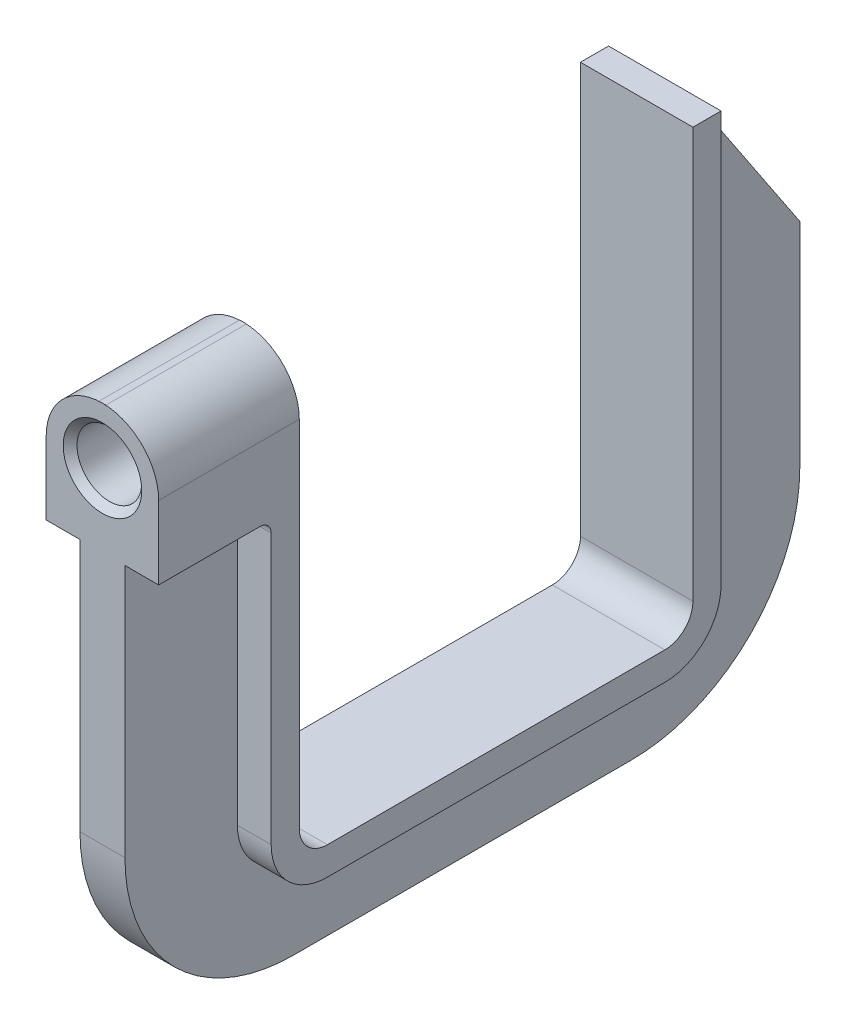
ISO-10303-21;
HEADER;
FILE_DESCRIPTION(('STEP AP214'),'2;1');
FILE_NAME('part.step','',(''),(''),'','','');
FILE_SCHEMA(('AUTOMOTIVE_DESIGN { 1 0 10303 214 1 1 1 1 }'));
ENDSEC;
DATA;
#1=APPLICATION_CONTEXT('core data for automotive mechanical design processes');
#2=APPLICATION_PROTOCOL_DEFINITION('international standard','automotive_design',2000,#1);
#3=PRODUCT_CONTEXT('',#1,'mechanical');
#4=PRODUCT('Part','Part','',(#3));
#5=PRODUCT_RELATED_PRODUCT_CATEGORY('part','',(#4));
#6=PRODUCT_DEFINITION_FORMATION('','',#4);
#7=PRODUCT_DEFINITION_CONTEXT('part definition',#1,'design');
#8=PRODUCT_DEFINITION('design','',#6,#7);
#9=PRODUCT_DEFINITION_SHAPE('','',#8);
#10=(LENGTH_UNIT() NAMED_UNIT(*) SI_UNIT(.MILLI.,.METRE.));
#11=(NAMED_UNIT(*) PLANE_ANGLE_UNIT() SI_UNIT($,.RADIAN.));
#12=(NAMED_UNIT(*) SI_UNIT($,.STERADIAN.) SOLID_ANGLE_UNIT());
#13=UNCERTAINTY_MEASURE_WITH_UNIT(LENGTH_MEASURE(1.E-05),#10,'distance_accuracy_value','');
#14=(GEOMETRIC_REPRESENTATION_CONTEXT(3) GLOBAL_UNCERTAINTY_ASSIGNED_CONTEXT((#13)) GLOBAL_UNIT_ASSIGNED_CONTEXT((#10,
#11,#12)) REPRESENTATION_CONTEXT('',''));
#15=CARTESIAN_POINT('',(0.,0.,0.));
#16=DIRECTION('',(0.,0.,1.));
#17=DIRECTION('',(1.,0.,0.));
#18=AXIS2_PLACEMENT_3D('',#15,#16,#17);
#19=CARTESIAN_POINT('',(4.,0.,95.));
#20=DIRECTION('',(0.,0.,1.));
#21=DIRECTION('',(1.,0.,0.));
#22=AXIS2_PLACEMENT_3D('',#19,#20,#21);
#23=PLANE('',#22);
#24=CARTESIAN_POINT('',(0.,-10.0000173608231,95.));
#25=DIRECTION('',(0.,0.,1.));
#26=DIRECTION('',(1.,0.,0.));
#27=AXIS2_PLACEMENT_3D('',#24,#25,#26);
#28=CIRCLE('',#27,6.985);
#29=CARTESIAN_POINT('',(6.985,-10.0000173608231,95.));
#30=VERTEX_POINT('',#29);
#31=EDGE_CURVE('E570',#30,#30,#28,.T.);
#32=ORIENTED_EDGE('',*,*,#31,.F.);
#33=EDGE_LOOP('',(#32));
#34=FACE_BOUND('',#33,.T.);
#35=CARTESIAN_POINT('',(0.,-10.0000173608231,95.));
#36=DIRECTION('',(0.,0.,1.));
#37=DIRECTION('',(1.,0.,0.));
#38=AXIS2_PLACEMENT_3D('',#35,#36,#37);
#39=CIRCLE('',#38,10.0000173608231);
#40=CARTESIAN_POINT('',(10.,-9.98138360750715,95.));
#41=VERTEX_POINT('',#40);
#42=CARTESIAN_POINT('',(-10.,-9.98138360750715,95.));
#43=VERTEX_POINT('',#42);
#44=EDGE_CURVE('E296',#41,#43,#39,.T.);
#45=ORIENTED_EDGE('',*,*,#44,.T.);
#46=DIRECTION('',(0.,-1.,0.));
#47=VECTOR('',#46,1.);
#48=CARTESIAN_POINT('',(-10.,-9.98138360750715,95.));
#49=LINE('',#48,#47);
#50=CARTESIAN_POINT('',(-10.,-23.,95.));
#51=VERTEX_POINT('',#50);
#52=EDGE_CURVE('E292',#43,#51,#49,.T.);
#53=ORIENTED_EDGE('',*,*,#52,.T.);
#54=DIRECTION('',(1.,0.,0.));
#55=VECTOR('',#54,1.);
#56=CARTESIAN_POINT('',(-10.,-23.,95.));
#57=LINE('',#56,#55);
#58=CARTESIAN_POINT('',(-4.,-23.,95.));
#59=VERTEX_POINT('',#58);
#60=EDGE_CURVE('E283',#51,#59,#57,.T.);
#61=ORIENTED_EDGE('',*,*,#60,.T.);
#62=DIRECTION('',(0.,1.,0.));
#63=VECTOR('',#62,1.);
#64=CARTESIAN_POINT('',(-4.,0.,95.));
#65=LINE('',#64,#63);
#66=CARTESIAN_POINT('',(-4.,-67.9999999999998,95.));
#67=VERTEX_POINT('',#66);
#68=EDGE_CURVE('E355',#67,#59,#65,.T.);
#69=ORIENTED_EDGE('',*,*,#68,.F.);
#70=DIRECTION('',(-1.,0.,0.));
#71=VECTOR('',#70,1.);
#72=CARTESIAN_POINT('',(4.,-67.9999999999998,95.));
#73=LINE('',#72,#71);
#74=CARTESIAN_POINT('',(4.,-67.9999999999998,95.));
#75=VERTEX_POINT('',#74);
#76=EDGE_CURVE('E281',#75,#67,#73,.T.);
#77=ORIENTED_EDGE('',*,*,#76,.F.);
#78=DIRECTION('',(0.,1.,0.));
#79=VECTOR('',#78,1.);
#80=CARTESIAN_POINT('',(4.,0.,95.));
#81=LINE('',#80,#79);
#82=CARTESIAN_POINT('',(4.,-23.,95.));
#83=VERTEX_POINT('',#82);
#84=EDGE_CURVE('E264',#75,#83,#81,.T.);
#85=ORIENTED_EDGE('',*,*,#84,.T.);
#86=CARTESIAN_POINT('',(10.,-23.,95.));
#87=VERTEX_POINT('',#86);
#88=EDGE_CURVE('E278',#83,#87,#57,.T.);
#89=ORIENTED_EDGE('',*,*,#88,.T.);
#90=DIRECTION('',(0.,1.,0.));
#91=VECTOR('',#90,1.);
#92=CARTESIAN_POINT('',(10.,-23.,95.));
#93=LINE('',#92,#91);
#94=EDGE_CURVE('E286',#87,#41,#93,.T.);
#95=ORIENTED_EDGE('',*,*,#94,.T.);
#96=EDGE_LOOP('',(#45,#53,#61,#69,#77,#85,#89,#95));
#97=FACE_BOUND('',#96,.T.);
#98=ADVANCED_FACE('F75',(#34,#97),#23,.T.);
#99=CARTESIAN_POINT('',(10.,0.,70.));
#100=DIRECTION('',(0.,0.,1.));
#101=DIRECTION('',(1.,0.,0.));
#102=AXIS2_PLACEMENT_3D('',#99,#100,#101);
#103=PLANE('',#102);
#104=CARTESIAN_POINT('',(0.,-10.0000173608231,70.));
#105=DIRECTION('',(0.,0.,1.));
#106=DIRECTION('',(1.,0.,0.));
#107=AXIS2_PLACEMENT_3D('',#104,#105,#106);
#108=CIRCLE('',#107,5.75436999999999);
#109=CARTESIAN_POINT('',(5.75436999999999,-10.0000173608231,70.));
#110=VERTEX_POINT('',#109);
#111=EDGE_CURVE('E298',#110,#110,#108,.T.);
#112=ORIENTED_EDGE('',*,*,#111,.T.);
#113=EDGE_LOOP('',(#112));
#114=FACE_BOUND('',#113,.T.);
#115=CARTESIAN_POINT('',(0.,-10.0000173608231,70.));
#116=DIRECTION('',(0.,0.,1.));
#117=DIRECTION('',(1.,0.,0.));
#118=AXIS2_PLACEMENT_3D('',#115,#116,#117);
#119=CIRCLE('',#118,10.0000173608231);
#120=CARTESIAN_POINT('',(-10.,-9.98138360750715,70.));
#121=VERTEX_POINT('',#120);
#122=CARTESIAN_POINT('',(10.,-9.98138360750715,70.));
#123=VERTEX_POINT('',#122);
#124=EDGE_CURVE('E288',#121,#123,#119,.F.);
#125=ORIENTED_EDGE('',*,*,#124,.T.);
#126=DIRECTION('',(0.,1.,0.));
#127=VECTOR('',#126,1.);
#128=CARTESIAN_POINT('',(10.,0.,70.));
#129=LINE('',#128,#127);
#130=CARTESIAN_POINT('',(10.,-73.,70.));
#131=VERTEX_POINT('',#130);
#132=EDGE_CURVE('E331',#131,#123,#129,.T.);
#133=ORIENTED_EDGE('',*,*,#132,.F.);
#134=DIRECTION('',(-1.,0.,0.));
#135=VECTOR('',#134,1.);
#136=CARTESIAN_POINT('',(10.,-73.,70.));
#137=LINE('',#136,#135);
#138=CARTESIAN_POINT('',(-10.,-73.,70.));
#139=VERTEX_POINT('',#138);
#140=EDGE_CURVE('E302',#131,#139,#137,.T.);
#141=ORIENTED_EDGE('',*,*,#140,.T.);
#142=DIRECTION('',(0.,1.,0.));
#143=VECTOR('',#142,1.);
#144=CARTESIAN_POINT('',(-10.,0.,70.));
#145=LINE('',#144,#143);
#146=EDGE_CURVE('E445',#139,#121,#145,.T.);
#147=ORIENTED_EDGE('',*,*,#146,.T.);
#148=EDGE_LOOP('',(#125,#133,#141,#147));
#149=FACE_BOUND('',#148,.T.);
#150=ADVANCED_FACE('F499',(#114,#149),#103,.F.);
#151=CARTESIAN_POINT('',(-10.,0.,0.));
#152=DIRECTION('',(1.,0.,0.));
#153=DIRECTION('',(0.,0.,-1.));
#154=AXIS2_PLACEMENT_3D('',#151,#152,#153);
#155=PLANE('',#154);
#156=DIRECTION('',(0.,0.,1.));
#157=VECTOR('',#156,1.);
#158=CARTESIAN_POINT('',(-10.,-9.98138360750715,55.8710220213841));
#159=LINE('',#158,#157);
#160=EDGE_CURVE('E303',#121,#43,#159,.T.);
#161=ORIENTED_EDGE('',*,*,#160,.F.);
#162=ORIENTED_EDGE('',*,*,#146,.F.);
#163=CARTESIAN_POINT('',(-10.,-73.,65.));
#164=DIRECTION('',(1.,0.,0.));
#165=DIRECTION('',(0.,0.,-1.));
#166=AXIS2_PLACEMENT_3D('',#163,#164,#165);
#167=CIRCLE('',#166,5.);
#168=CARTESIAN_POINT('',(-10.,-78.,65.));
#169=VERTEX_POINT('',#168);
#170=EDGE_CURVE('E440',#169,#139,#167,.F.);
#171=ORIENTED_EDGE('',*,*,#170,.F.);
#172=DIRECTION('',(0.,0.,1.));
#173=VECTOR('',#172,1.);
#174=CARTESIAN_POINT('',(-10.,-78.,0.));
#175=LINE('',#174,#173);
#176=CARTESIAN_POINT('',(-10.,-78.,4.99999999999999));
#177=VERTEX_POINT('',#176);
#178=EDGE_CURVE('E436',#177,#169,#175,.T.);
#179=ORIENTED_EDGE('',*,*,#178,.F.);
#180=CARTESIAN_POINT('',(-10.,-73.,4.99999999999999));
#181=DIRECTION('',(1.,0.,0.));
#182=DIRECTION('',(0.,0.,-1.));
#183=AXIS2_PLACEMENT_3D('',#180,#181,#182);
#184=CIRCLE('',#183,5.);
#185=CARTESIAN_POINT('',(-10.,-73.,0.));
#186=VERTEX_POINT('',#185);
#187=EDGE_CURVE('E431',#186,#177,#184,.F.);
#188=ORIENTED_EDGE('',*,*,#187,.F.);
#189=DIRECTION('',(0.,-1.,0.));
#190=VECTOR('',#189,1.);
#191=CARTESIAN_POINT('',(-10.,0.,0.));
#192=LINE('',#191,#190);
#193=CARTESIAN_POINT('',(-10.,0.,0.));
#194=VERTEX_POINT('',#193);
#195=EDGE_CURVE('E432',#194,#186,#192,.T.);
#196=ORIENTED_EDGE('',*,*,#195,.F.);
#197=DIRECTION('',(0.,0.,-1.));
#198=VECTOR('',#197,1.);
#199=CARTESIAN_POINT('',(-10.,0.,0.));
#200=LINE('',#199,#198);
#201=CARTESIAN_POINT('',(-10.,0.,-5.));
#202=VERTEX_POINT('',#201);
#203=EDGE_CURVE('E451',#194,#202,#200,.T.);
#204=ORIENTED_EDGE('',*,*,#203,.T.);
#205=DIRECTION('',(0.,-1.,0.));
#206=VECTOR('',#205,1.);
#207=CARTESIAN_POINT('',(-10.,0.,-5.));
#208=LINE('',#207,#206);
#209=CARTESIAN_POINT('',(-10.,-73.,-5.00000000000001));
#210=VERTEX_POINT('',#209);
#211=EDGE_CURVE('E458',#202,#210,#208,.T.);
#212=ORIENTED_EDGE('',*,*,#211,.T.);
#213=CARTESIAN_POINT('',(-10.,-73.,4.99999999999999));
#214=DIRECTION('',(1.,0.,0.));
#215=DIRECTION('',(0.,0.,-1.));
#216=AXIS2_PLACEMENT_3D('',#213,#214,#215);
#217=CIRCLE('',#216,10.);
#218=CARTESIAN_POINT('',(-10.,-83.,4.99999999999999));
#219=VERTEX_POINT('',#218);
#220=EDGE_CURVE('E461',#210,#219,#217,.F.);
#221=ORIENTED_EDGE('',*,*,#220,.T.);
#222=DIRECTION('',(0.,0.,1.));
#223=VECTOR('',#222,1.);
#224=CARTESIAN_POINT('',(-10.,-83.,0.));
#225=LINE('',#224,#223);
#226=CARTESIAN_POINT('',(-10.,-83.,65.));
#227=VERTEX_POINT('',#226);
#228=EDGE_CURVE('E464',#219,#227,#225,.T.);
#229=ORIENTED_EDGE('',*,*,#228,.T.);
#230=CARTESIAN_POINT('',(-10.,-73.,65.));
#231=DIRECTION('',(1.,0.,0.));
#232=DIRECTION('',(0.,0.,-1.));
#233=AXIS2_PLACEMENT_3D('',#230,#231,#232);
#234=CIRCLE('',#233,10.);
#235=CARTESIAN_POINT('',(-10.,-73.,75.));
#236=VERTEX_POINT('',#235);
#237=EDGE_CURVE('E448',#227,#236,#234,.F.);
#238=ORIENTED_EDGE('',*,*,#237,.T.);
#239=DIRECTION('',(0.,1.,0.));
#240=VECTOR('',#239,1.);
#241=CARTESIAN_POINT('',(-10.,0.,75.));
#242=LINE('',#241,#240);
#243=CARTESIAN_POINT('',(-10.,-25.,75.));
#244=VERTEX_POINT('',#243);
#245=EDGE_CURVE('E324',#236,#244,#242,.T.);
#246=ORIENTED_EDGE('',*,*,#245,.T.);
#247=CARTESIAN_POINT('',(-10.,-25.,77.));
#248=DIRECTION('',(1.,0.,0.));
#249=DIRECTION('',(0.,0.,-1.));
#250=AXIS2_PLACEMENT_3D('',#247,#248,#249);
#251=CIRCLE('',#250,2.);
#252=CARTESIAN_POINT('',(-10.,-23.,77.));
#253=VERTEX_POINT('',#252);
#254=EDGE_CURVE('E83',#244,#253,#251,.T.);
#255=ORIENTED_EDGE('',*,*,#254,.T.);
#256=DIRECTION('',(0.,0.,1.));
#257=VECTOR('',#256,1.);
#258=CARTESIAN_POINT('',(-10.,-23.,39.5064482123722));
#259=LINE('',#258,#257);
#260=EDGE_CURVE('E321',#253,#51,#259,.T.);
#261=ORIENTED_EDGE('',*,*,#260,.T.);
#262=ORIENTED_EDGE('',*,*,#52,.F.);
#263=EDGE_LOOP('',(#161,#162,#171,#179,#188,#196,#204,#212,#221,#229,#238,#246,#255,#261,#262));
#264=FACE_BOUND('',#263,.T.);
#265=ADVANCED_FACE('F320',(#264),#155,.F.);
#266=CARTESIAN_POINT('',(10.,0.,0.));
#267=DIRECTION('',(1.,0.,0.));
#268=DIRECTION('',(0.,0.,-1.));
#269=AXIS2_PLACEMENT_3D('',#266,#267,#268);
#270=PLANE('',#269);
#271=ORIENTED_EDGE('',*,*,#132,.T.);
#272=DIRECTION('',(0.,0.,1.));
#273=VECTOR('',#272,1.);
#274=CARTESIAN_POINT('',(10.,-9.98138360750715,39.5064482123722));
#275=LINE('',#274,#273);
#276=EDGE_CURVE('E471',#123,#41,#275,.T.);
#277=ORIENTED_EDGE('',*,*,#276,.T.);
#278=ORIENTED_EDGE('',*,*,#94,.F.);
#279=DIRECTION('',(0.,0.,1.));
#280=VECTOR('',#279,1.);
#281=CARTESIAN_POINT('',(10.,-23.,39.5064482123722));
#282=LINE('',#281,#280);
#283=CARTESIAN_POINT('',(10.,-23.,77.));
#284=VERTEX_POINT('',#283);
#285=EDGE_CURVE('E271',#284,#87,#282,.T.);
#286=ORIENTED_EDGE('',*,*,#285,.F.);
#287=CARTESIAN_POINT('',(10.,-25.,77.));
#288=DIRECTION('',(1.,0.,0.));
#289=DIRECTION('',(0.,0.,-1.));
#290=AXIS2_PLACEMENT_3D('',#287,#288,#289);
#291=CIRCLE('',#290,2.);
#292=CARTESIAN_POINT('',(10.,-25.,75.));
#293=VERTEX_POINT('',#292);
#294=EDGE_CURVE('E13',#284,#293,#291,.F.);
#295=ORIENTED_EDGE('',*,*,#294,.T.);
#296=DIRECTION('',(0.,1.,0.));
#297=VECTOR('',#296,1.);
#298=CARTESIAN_POINT('',(10.,0.,75.));
#299=LINE('',#298,#297);
#300=CARTESIAN_POINT('',(10.,-73.,75.));
#301=VERTEX_POINT('',#300);
#302=EDGE_CURVE('E272',#301,#293,#299,.T.);
#303=ORIENTED_EDGE('',*,*,#302,.F.);
#304=CARTESIAN_POINT('',(10.,-73.,65.));
#305=DIRECTION('',(1.,0.,0.));
#306=DIRECTION('',(0.,0.,-1.));
#307=AXIS2_PLACEMENT_3D('',#304,#305,#306);
#308=CIRCLE('',#307,10.);
#309=CARTESIAN_POINT('',(10.,-83.,65.));
#310=VERTEX_POINT('',#309);
#311=EDGE_CURVE('E348',#310,#301,#308,.F.);
#312=ORIENTED_EDGE('',*,*,#311,.F.);
#313=DIRECTION('',(0.,0.,1.));
#314=VECTOR('',#313,1.);
#315=CARTESIAN_POINT('',(10.,-83.,0.));
#316=LINE('',#315,#314);
#317=CARTESIAN_POINT('',(10.,-83.,4.99999999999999));
#318=VERTEX_POINT('',#317);
#319=EDGE_CURVE('E416',#318,#310,#316,.T.);
#320=ORIENTED_EDGE('',*,*,#319,.F.);
#321=CARTESIAN_POINT('',(10.,-73.,4.99999999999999));
#322=DIRECTION('',(1.,0.,0.));
#323=DIRECTION('',(0.,0.,-1.));
#324=AXIS2_PLACEMENT_3D('',#321,#322,#323);
#325=CIRCLE('',#324,10.);
#326=CARTESIAN_POINT('',(10.,-73.,-5.00000000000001));
#327=VERTEX_POINT('',#326);
#328=EDGE_CURVE('E419',#327,#318,#325,.F.);
#329=ORIENTED_EDGE('',*,*,#328,.F.);
#330=DIRECTION('',(0.,-1.,0.));
#331=VECTOR('',#330,1.);
#332=CARTESIAN_POINT('',(10.,0.,-5.));
#333=LINE('',#332,#331);
#334=CARTESIAN_POINT('',(10.,0.,-5.));
#335=VERTEX_POINT('',#334);
#336=EDGE_CURVE('E422',#335,#327,#333,.T.);
#337=ORIENTED_EDGE('',*,*,#336,.F.);
#338=DIRECTION('',(0.,0.,-1.));
#339=VECTOR('',#338,1.);
#340=CARTESIAN_POINT('',(10.,0.,0.));
#341=LINE('',#340,#339);
#342=CARTESIAN_POINT('',(10.,0.,0.));
#343=VERTEX_POINT('',#342);
#344=EDGE_CURVE('E427',#343,#335,#341,.T.);
#345=ORIENTED_EDGE('',*,*,#344,.F.);
#346=DIRECTION('',(0.,-1.,0.));
#347=VECTOR('',#346,1.);
#348=CARTESIAN_POINT('',(10.,0.,0.));
#349=LINE('',#348,#347);
#350=CARTESIAN_POINT('',(10.,-73.,0.));
#351=VERTEX_POINT('',#350);
#352=EDGE_CURVE('E477',#343,#351,#349,.T.);
#353=ORIENTED_EDGE('',*,*,#352,.T.);
#354=CARTESIAN_POINT('',(10.,-73.,4.99999999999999));
#355=DIRECTION('',(1.,0.,0.));
#356=DIRECTION('',(0.,0.,-1.));
#357=AXIS2_PLACEMENT_3D('',#354,#355,#356);
#358=CIRCLE('',#357,5.);
#359=CARTESIAN_POINT('',(10.,-78.,4.99999999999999));
#360=VERTEX_POINT('',#359);
#361=EDGE_CURVE('E475',#351,#360,#358,.F.);
#362=ORIENTED_EDGE('',*,*,#361,.T.);
#363=DIRECTION('',(0.,0.,1.));
#364=VECTOR('',#363,1.);
#365=CARTESIAN_POINT('',(10.,-78.,0.));
#366=LINE('',#365,#364);
#367=CARTESIAN_POINT('',(10.,-78.,65.));
#368=VERTEX_POINT('',#367);
#369=EDGE_CURVE('E473',#360,#368,#366,.T.);
#370=ORIENTED_EDGE('',*,*,#369,.T.);
#371=CARTESIAN_POINT('',(10.,-73.,65.));
#372=DIRECTION('',(1.,0.,0.));
#373=DIRECTION('',(0.,0.,-1.));
#374=AXIS2_PLACEMENT_3D('',#371,#372,#373);
#375=CIRCLE('',#374,5.);
#376=EDGE_CURVE('E412',#368,#131,#375,.F.);
#377=ORIENTED_EDGE('',*,*,#376,.T.);
#378=EDGE_LOOP('',(#271,#277,#278,#286,#295,#303,#312,#320,#329,#337,#345,#353,#362,#370,#377));
#379=FACE_BOUND('',#378,.T.);
#380=ADVANCED_FACE('F493',(#379),#270,.T.);
#381=CARTESIAN_POINT('',(4.,-68.,65.));
#382=DIRECTION('',(-1.,0.,0.));
#383=DIRECTION('',(0.,0.,1.));
#384=AXIS2_PLACEMENT_3D('',#381,#382,#383);
#385=CYLINDRICAL_SURFACE('',#384,30.);
#386=CARTESIAN_POINT('',(-4.,-68.,65.));
#387=DIRECTION('',(1.,0.,0.));
#388=DIRECTION('',(0.,0.,-1.));
#389=AXIS2_PLACEMENT_3D('',#386,#387,#388);
#390=CIRCLE('',#389,30.);
#391=CARTESIAN_POINT('',(-4.,-98.,64.9999999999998));
#392=VERTEX_POINT('',#391);
#393=EDGE_CURVE('E359',#392,#67,#390,.F.);
#394=ORIENTED_EDGE('',*,*,#393,.F.);
#395=DIRECTION('',(-1.,0.,0.));
#396=VECTOR('',#395,1.);
#397=CARTESIAN_POINT('',(4.,-98.,64.9999999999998));
#398=LINE('',#397,#396);
#399=CARTESIAN_POINT('',(4.,-98.,64.9999999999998));
#400=VERTEX_POINT('',#399);
#401=EDGE_CURVE('E406',#400,#392,#398,.T.);
#402=ORIENTED_EDGE('',*,*,#401,.F.);
#403=CARTESIAN_POINT('',(4.,-68.,65.));
#404=DIRECTION('',(1.,0.,0.));
#405=DIRECTION('',(0.,0.,-1.));
#406=AXIS2_PLACEMENT_3D('',#403,#404,#405);
#407=CIRCLE('',#406,30.);
#408=EDGE_CURVE('E410',#400,#75,#407,.F.);
#409=ORIENTED_EDGE('',*,*,#408,.T.);
#410=ORIENTED_EDGE('',*,*,#76,.T.);
#411=EDGE_LOOP('',(#394,#402,#409,#410));
#412=FACE_BOUND('',#411,.T.);
#413=ADVANCED_FACE('F561',(#412),#385,.T.);
#414=CARTESIAN_POINT('',(4.,-98.,0.));
#415=DIRECTION('',(0.,-1.,0.));
#416=DIRECTION('',(0.,0.,-1.));
#417=AXIS2_PLACEMENT_3D('',#414,#415,#416);
#418=PLANE('',#417);
#419=DIRECTION('',(0.,0.,1.));
#420=VECTOR('',#419,1.);
#421=CARTESIAN_POINT('',(-4.,-98.,0.));
#422=LINE('',#421,#420);
#423=CARTESIAN_POINT('',(-4.,-98.,5.00000000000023));
#424=VERTEX_POINT('',#423);
#425=EDGE_CURVE('E379',#424,#392,#422,.T.);
#426=ORIENTED_EDGE('',*,*,#425,.F.);
#427=DIRECTION('',(-1.,0.,0.));
#428=VECTOR('',#427,1.);
#429=CARTESIAN_POINT('',(4.,-98.,5.00000000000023));
#430=LINE('',#429,#428);
#431=CARTESIAN_POINT('',(4.,-98.,5.00000000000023));
#432=VERTEX_POINT('',#431);
#433=EDGE_CURVE('E402',#432,#424,#430,.T.);
#434=ORIENTED_EDGE('',*,*,#433,.F.);
#435=DIRECTION('',(0.,0.,1.));
#436=VECTOR('',#435,1.);
#437=CARTESIAN_POINT('',(4.,-98.,0.));
#438=LINE('',#437,#436);
#439=EDGE_CURVE('E407',#432,#400,#438,.T.);
#440=ORIENTED_EDGE('',*,*,#439,.T.);
#441=ORIENTED_EDGE('',*,*,#401,.T.);
#442=EDGE_LOOP('',(#426,#434,#440,#441));
#443=FACE_BOUND('',#442,.T.);
#444=ADVANCED_FACE('F557',(#443),#418,.T.);
#445=CARTESIAN_POINT('',(4.,-68.,5.));
#446=DIRECTION('',(-1.,0.,0.));
#447=DIRECTION('',(0.,0.,1.));
#448=AXIS2_PLACEMENT_3D('',#445,#446,#447);
#449=CYLINDRICAL_SURFACE('',#448,30.);
#450=CARTESIAN_POINT('',(-4.,-68.,5.));
#451=DIRECTION('',(1.,0.,0.));
#452=DIRECTION('',(0.,0.,-1.));
#453=AXIS2_PLACEMENT_3D('',#450,#451,#452);
#454=CIRCLE('',#453,30.);
#455=CARTESIAN_POINT('',(-4.,-67.9999999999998,-25.));
#456=VERTEX_POINT('',#455);
#457=EDGE_CURVE('E376',#456,#424,#454,.F.);
#458=ORIENTED_EDGE('',*,*,#457,.F.);
#459=DIRECTION('',(-1.,0.,0.));
#460=VECTOR('',#459,1.);
#461=CARTESIAN_POINT('',(4.,-67.9999999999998,-25.));
#462=LINE('',#461,#460);
#463=CARTESIAN_POINT('',(4.,-67.9999999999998,-25.));
#464=VERTEX_POINT('',#463);
#465=EDGE_CURVE('E398',#464,#456,#462,.T.);
#466=ORIENTED_EDGE('',*,*,#465,.F.);
#467=CARTESIAN_POINT('',(4.,-68.,5.));
#468=DIRECTION('',(1.,0.,0.));
#469=DIRECTION('',(0.,0.,-1.));
#470=AXIS2_PLACEMENT_3D('',#467,#468,#469);
#471=CIRCLE('',#470,30.);
#472=EDGE_CURVE('E403',#464,#432,#471,.F.);
#473=ORIENTED_EDGE('',*,*,#472,.T.);
#474=ORIENTED_EDGE('',*,*,#433,.T.);
#475=EDGE_LOOP('',(#458,#466,#473,#474));
#476=FACE_BOUND('',#475,.T.);
#477=ADVANCED_FACE('F552',(#476),#449,.T.);
#478=CARTESIAN_POINT('',(4.,0.,-25.));
#479=DIRECTION('',(0.,0.,-1.));
#480=DIRECTION('',(0.,1.,0.));
#481=AXIS2_PLACEMENT_3D('',#478,#479,#480);
#482=PLANE('',#481);
#483=DIRECTION('',(0.,-1.,0.));
#484=VECTOR('',#483,1.);
#485=CARTESIAN_POINT('',(-4.,0.,-25.));
#486=LINE('',#485,#484);
#487=CARTESIAN_POINT('',(-4.,-30.,-25.));
#488=VERTEX_POINT('',#487);
#489=EDGE_CURVE('E373',#488,#456,#486,.T.);
#490=ORIENTED_EDGE('',*,*,#489,.F.);
#491=DIRECTION('',(-1.,0.,0.));
#492=VECTOR('',#491,1.);
#493=CARTESIAN_POINT('',(4.,-30.,-25.));
#494=LINE('',#493,#492);
#495=CARTESIAN_POINT('',(4.,-30.,-25.));
#496=VERTEX_POINT('',#495);
#497=EDGE_CURVE('E394',#496,#488,#494,.T.);
#498=ORIENTED_EDGE('',*,*,#497,.F.);
#499=DIRECTION('',(0.,-1.,0.));
#500=VECTOR('',#499,1.);
#501=CARTESIAN_POINT('',(4.,0.,-25.));
#502=LINE('',#501,#500);
#503=EDGE_CURVE('E399',#496,#464,#502,.T.);
#504=ORIENTED_EDGE('',*,*,#503,.T.);
#505=ORIENTED_EDGE('',*,*,#465,.T.);
#506=EDGE_LOOP('',(#490,#498,#504,#505));
#507=FACE_BOUND('',#506,.T.);
#508=ADVANCED_FACE('F548',(#507),#482,.T.);
#509=CARTESIAN_POINT('',(4.,2.30769230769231,-3.46153846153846));
#510=DIRECTION('',(0.,0.554700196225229,-0.832050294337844));
#511=DIRECTION('',(0.,0.832050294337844,0.554700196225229));
#512=AXIS2_PLACEMENT_3D('',#509,#510,#511);
#513=PLANE('',#512);
#514=DIRECTION('',(0.,-0.832050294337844,-0.554700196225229));
#515=VECTOR('',#514,1.);
#516=CARTESIAN_POINT('',(-4.,2.30769230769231,-3.46153846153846));
#517=LINE('',#516,#515);
#518=CARTESIAN_POINT('',(-4.,0.,-5.));
#519=VERTEX_POINT('',#518);
#520=EDGE_CURVE('E370',#519,#488,#517,.T.);
#521=ORIENTED_EDGE('',*,*,#520,.F.);
#522=DIRECTION('',(-1.,0.,0.));
#523=VECTOR('',#522,1.);
#524=CARTESIAN_POINT('',(4.,0.,-5.));
#525=LINE('',#524,#523);
#526=CARTESIAN_POINT('',(4.,0.,-5.));
#527=VERTEX_POINT('',#526);
#528=EDGE_CURVE('E426',#527,#519,#525,.T.);
#529=ORIENTED_EDGE('',*,*,#528,.F.);
#530=DIRECTION('',(0.,-0.832050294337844,-0.554700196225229));
#531=VECTOR('',#530,1.);
#532=CARTESIAN_POINT('',(4.,2.30769230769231,-3.46153846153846));
#533=LINE('',#532,#531);
#534=EDGE_CURVE('E395',#527,#496,#533,.T.);
#535=ORIENTED_EDGE('',*,*,#534,.T.);
#536=ORIENTED_EDGE('',*,*,#497,.T.);
#537=EDGE_LOOP('',(#521,#529,#535,#536));
#538=FACE_BOUND('',#537,.T.);
#539=ADVANCED_FACE('F542',(#538),#513,.T.);
#540=CARTESIAN_POINT('',(4.,0.,0.));
#541=DIRECTION('',(1.,0.,0.));
#542=DIRECTION('',(0.,0.,-1.));
#543=AXIS2_PLACEMENT_3D('',#540,#541,#542);
#544=PLANE('',#543);
#545=DIRECTION('',(0.,1.,0.));
#546=VECTOR('',#545,1.);
#547=CARTESIAN_POINT('',(4.,0.,75.));
#548=LINE('',#547,#546);
#549=CARTESIAN_POINT('',(4.,-73.,75.));
#550=VERTEX_POINT('',#549);
#551=CARTESIAN_POINT('',(4.,-25.,75.));
#552=VERTEX_POINT('',#551);
#553=EDGE_CURVE('E384',#550,#552,#548,.T.);
#554=ORIENTED_EDGE('',*,*,#553,.T.);
#555=CARTESIAN_POINT('',(4.,-25.,77.));
#556=DIRECTION('',(1.,0.,0.));
#557=DIRECTION('',(0.,0.,-1.));
#558=AXIS2_PLACEMENT_3D('',#555,#556,#557);
#559=CIRCLE('',#558,2.);
#560=CARTESIAN_POINT('',(4.,-23.,77.));
#561=VERTEX_POINT('',#560);
#562=EDGE_CURVE('E266',#552,#561,#559,.T.);
#563=ORIENTED_EDGE('',*,*,#562,.T.);
#564=DIRECTION('',(0.,0.,-1.));
#565=VECTOR('',#564,1.);
#566=CARTESIAN_POINT('',(4.,-23.,0.));
#567=LINE('',#566,#565);
#568=EDGE_CURVE('E260',#83,#561,#567,.T.);
#569=ORIENTED_EDGE('',*,*,#568,.F.);
#570=ORIENTED_EDGE('',*,*,#84,.F.);
#571=ORIENTED_EDGE('',*,*,#408,.F.);
#572=ORIENTED_EDGE('',*,*,#439,.F.);
#573=ORIENTED_EDGE('',*,*,#472,.F.);
#574=ORIENTED_EDGE('',*,*,#503,.F.);
#575=ORIENTED_EDGE('',*,*,#534,.F.);
#576=DIRECTION('',(0.,-1.,0.));
#577=VECTOR('',#576,1.);
#578=CARTESIAN_POINT('',(4.,0.,-5.));
#579=LINE('',#578,#577);
#580=CARTESIAN_POINT('',(4.,-73.,-5.00000000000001));
#581=VERTEX_POINT('',#580);
#582=EDGE_CURVE('E392',#527,#581,#579,.T.);
#583=ORIENTED_EDGE('',*,*,#582,.T.);
#584=CARTESIAN_POINT('',(4.,-73.,4.99999999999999));
#585=DIRECTION('',(1.,0.,0.));
#586=DIRECTION('',(0.,0.,-1.));
#587=AXIS2_PLACEMENT_3D('',#584,#585,#586);
#588=CIRCLE('',#587,10.);
#589=CARTESIAN_POINT('',(4.,-83.,4.99999999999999));
#590=VERTEX_POINT('',#589);
#591=EDGE_CURVE('E390',#581,#590,#588,.F.);
#592=ORIENTED_EDGE('',*,*,#591,.T.);
#593=DIRECTION('',(0.,0.,1.));
#594=VECTOR('',#593,1.);
#595=CARTESIAN_POINT('',(4.,-83.,0.));
#596=LINE('',#595,#594);
#597=CARTESIAN_POINT('',(4.,-83.,65.));
#598=VERTEX_POINT('',#597);
#599=EDGE_CURVE('E388',#590,#598,#596,.T.);
#600=ORIENTED_EDGE('',*,*,#599,.T.);
#601=CARTESIAN_POINT('',(4.,-73.,65.));
#602=DIRECTION('',(1.,0.,0.));
#603=DIRECTION('',(0.,0.,-1.));
#604=AXIS2_PLACEMENT_3D('',#601,#602,#603);
#605=CIRCLE('',#604,10.);
#606=EDGE_CURVE('E386',#598,#550,#605,.F.);
#607=ORIENTED_EDGE('',*,*,#606,.T.);
#608=EDGE_LOOP('',(#554,#563,#569,#570,#571,#572,#573,#574,#575,#583,#592,#600,#607));
#609=FACE_BOUND('',#608,.T.);
#610=ADVANCED_FACE('F262',(#609),#544,.T.);
#611=CARTESIAN_POINT('',(-4.,0.,0.));
#612=DIRECTION('',(1.,0.,0.));
#613=DIRECTION('',(0.,0.,-1.));
#614=AXIS2_PLACEMENT_3D('',#611,#612,#613);
#615=PLANE('',#614);
#616=DIRECTION('',(0.,0.,-1.));
#617=VECTOR('',#616,1.);
#618=CARTESIAN_POINT('',(-4.,-23.,0.));
#619=LINE('',#618,#617);
#620=CARTESIAN_POINT('',(-4.,-23.,77.));
#621=VERTEX_POINT('',#620);
#622=EDGE_CURVE('E339',#59,#621,#619,.T.);
#623=ORIENTED_EDGE('',*,*,#622,.T.);
#624=CARTESIAN_POINT('',(-4.,-25.,77.));
#625=DIRECTION('',(1.,0.,0.));
#626=DIRECTION('',(0.,0.,-1.));
#627=AXIS2_PLACEMENT_3D('',#624,#625,#626);
#628=CIRCLE('',#627,2.);
#629=CARTESIAN_POINT('',(-4.,-25.,75.));
#630=VERTEX_POINT('',#629);
#631=EDGE_CURVE('E308',#621,#630,#628,.F.);
#632=ORIENTED_EDGE('',*,*,#631,.T.);
#633=DIRECTION('',(0.,1.,0.));
#634=VECTOR('',#633,1.);
#635=CARTESIAN_POINT('',(-4.,0.,75.));
#636=LINE('',#635,#634);
#637=CARTESIAN_POINT('',(-4.,-73.,75.));
#638=VERTEX_POINT('',#637);
#639=EDGE_CURVE('E337',#638,#630,#636,.T.);
#640=ORIENTED_EDGE('',*,*,#639,.F.);
#641=CARTESIAN_POINT('',(-4.,-73.,65.));
#642=DIRECTION('',(1.,0.,0.));
#643=DIRECTION('',(0.,0.,-1.));
#644=AXIS2_PLACEMENT_3D('',#641,#642,#643);
#645=CIRCLE('',#644,10.);
#646=CARTESIAN_POINT('',(-4.,-83.,65.));
#647=VERTEX_POINT('',#646);
#648=EDGE_CURVE('E357',#647,#638,#645,.F.);
#649=ORIENTED_EDGE('',*,*,#648,.F.);
#650=DIRECTION('',(0.,0.,1.));
#651=VECTOR('',#650,1.);
#652=CARTESIAN_POINT('',(-4.,-83.,0.));
#653=LINE('',#652,#651);
#654=CARTESIAN_POINT('',(-4.,-83.,4.99999999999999));
#655=VERTEX_POINT('',#654);
#656=EDGE_CURVE('E360',#655,#647,#653,.T.);
#657=ORIENTED_EDGE('',*,*,#656,.F.);
#658=CARTESIAN_POINT('',(-4.,-73.,4.99999999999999));
#659=DIRECTION('',(1.,0.,0.));
#660=DIRECTION('',(0.,0.,-1.));
#661=AXIS2_PLACEMENT_3D('',#658,#659,#660);
#662=CIRCLE('',#661,10.);
#663=CARTESIAN_POINT('',(-4.,-73.,-5.00000000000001));
#664=VERTEX_POINT('',#663);
#665=EDGE_CURVE('E364',#664,#655,#662,.F.);
#666=ORIENTED_EDGE('',*,*,#665,.F.);
#667=DIRECTION('',(0.,-1.,0.));
#668=VECTOR('',#667,1.);
#669=CARTESIAN_POINT('',(-4.,0.,-5.));
#670=LINE('',#669,#668);
#671=EDGE_CURVE('E350',#519,#664,#670,.T.);
#672=ORIENTED_EDGE('',*,*,#671,.F.);
#673=ORIENTED_EDGE('',*,*,#520,.T.);
#674=ORIENTED_EDGE('',*,*,#489,.T.);
#675=ORIENTED_EDGE('',*,*,#457,.T.);
#676=ORIENTED_EDGE('',*,*,#425,.T.);
#677=ORIENTED_EDGE('',*,*,#393,.T.);
#678=ORIENTED_EDGE('',*,*,#68,.T.);
#679=EDGE_LOOP('',(#623,#632,#640,#649,#657,#666,#672,#673,#674,#675,#676,#677,#678));
#680=FACE_BOUND('',#679,.T.);
#681=ADVANCED_FACE('F336',(#680),#615,.F.);
#682=CARTESIAN_POINT('',(10.,-73.,65.));
#683=DIRECTION('',(-1.,0.,0.));
#684=DIRECTION('',(0.,0.,1.));
#685=AXIS2_PLACEMENT_3D('',#682,#683,#684);
#686=CYLINDRICAL_SURFACE('',#685,10.);
#687=ORIENTED_EDGE('',*,*,#648,.T.);
#688=DIRECTION('',(-1.,0.,0.));
#689=VECTOR('',#688,1.);
#690=CARTESIAN_POINT('',(10.,-73.,75.));
#691=LINE('',#690,#689);
#692=EDGE_CURVE('E343',#638,#236,#691,.T.);
#693=ORIENTED_EDGE('',*,*,#692,.T.);
#694=ORIENTED_EDGE('',*,*,#237,.F.);
#695=DIRECTION('',(-1.,0.,0.));
#696=VECTOR('',#695,1.);
#697=CARTESIAN_POINT('',(10.,-83.,65.));
#698=LINE('',#697,#696);
#699=EDGE_CURVE('E363',#647,#227,#698,.T.);
#700=ORIENTED_EDGE('',*,*,#699,.F.);
#701=EDGE_LOOP('',(#687,#693,#694,#700));
#702=FACE_BOUND('',#701,.T.);
#703=ADVANCED_FACE('F539',(#702),#686,.T.);
#704=CARTESIAN_POINT('',(10.,-83.,0.));
#705=DIRECTION('',(0.,-1.,0.));
#706=DIRECTION('',(0.,0.,-1.));
#707=AXIS2_PLACEMENT_3D('',#704,#705,#706);
#708=PLANE('',#707);
#709=ORIENTED_EDGE('',*,*,#656,.T.);
#710=ORIENTED_EDGE('',*,*,#699,.T.);
#711=ORIENTED_EDGE('',*,*,#228,.F.);
#712=DIRECTION('',(-1.,0.,0.));
#713=VECTOR('',#712,1.);
#714=CARTESIAN_POINT('',(10.,-83.,4.99999999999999));
#715=LINE('',#714,#713);
#716=EDGE_CURVE('E367',#655,#219,#715,.T.);
#717=ORIENTED_EDGE('',*,*,#716,.F.);
#718=EDGE_LOOP('',(#709,#710,#711,#717));
#719=FACE_BOUND('',#718,.T.);
#720=ADVANCED_FACE('F535',(#719),#708,.T.);
#721=CARTESIAN_POINT('',(10.,-73.,4.99999999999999));
#722=DIRECTION('',(-1.,0.,0.));
#723=DIRECTION('',(0.,0.,1.));
#724=AXIS2_PLACEMENT_3D('',#721,#722,#723);
#725=CYLINDRICAL_SURFACE('',#724,10.);
#726=ORIENTED_EDGE('',*,*,#665,.T.);
#727=ORIENTED_EDGE('',*,*,#716,.T.);
#728=ORIENTED_EDGE('',*,*,#220,.F.);
#729=DIRECTION('',(-1.,0.,0.));
#730=VECTOR('',#729,1.);
#731=CARTESIAN_POINT('',(10.,-73.,-5.00000000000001));
#732=LINE('',#731,#730);
#733=EDGE_CURVE('E345',#664,#210,#732,.T.);
#734=ORIENTED_EDGE('',*,*,#733,.F.);
#735=EDGE_LOOP('',(#726,#727,#728,#734));
#736=FACE_BOUND('',#735,.T.);
#737=ADVANCED_FACE('F532',(#736),#725,.T.);
#738=CARTESIAN_POINT('',(10.,0.,-5.));
#739=DIRECTION('',(0.,0.,-1.));
#740=DIRECTION('',(0.,1.,0.));
#741=AXIS2_PLACEMENT_3D('',#738,#739,#740);
#742=PLANE('',#741);
#743=ORIENTED_EDGE('',*,*,#671,.T.);
#744=ORIENTED_EDGE('',*,*,#733,.T.);
#745=ORIENTED_EDGE('',*,*,#211,.F.);
#746=DIRECTION('',(-1.,0.,0.));
#747=VECTOR('',#746,1.);
#748=CARTESIAN_POINT('',(10.,0.,-5.));
#749=LINE('',#748,#747);
#750=EDGE_CURVE('E428',#519,#202,#749,.T.);
#751=ORIENTED_EDGE('',*,*,#750,.F.);
#752=EDGE_LOOP('',(#743,#744,#745,#751));
#753=FACE_BOUND('',#752,.T.);
#754=ADVANCED_FACE('F527',(#753),#742,.T.);
#755=CARTESIAN_POINT('',(10.,0.,75.));
#756=DIRECTION('',(0.,0.,1.));
#757=DIRECTION('',(0.,-1.,0.));
#758=AXIS2_PLACEMENT_3D('',#755,#756,#757);
#759=PLANE('',#758);
#760=ORIENTED_EDGE('',*,*,#639,.T.);
#761=DIRECTION('',(1.,0.,0.));
#762=VECTOR('',#761,1.);
#763=CARTESIAN_POINT('',(-10.,-25.,75.));
#764=LINE('',#763,#762);
#765=EDGE_CURVE('E310',#630,#244,#764,.F.);
#766=ORIENTED_EDGE('',*,*,#765,.T.);
#767=ORIENTED_EDGE('',*,*,#245,.F.);
#768=ORIENTED_EDGE('',*,*,#692,.F.);
#769=EDGE_LOOP('',(#760,#766,#767,#768));
#770=FACE_BOUND('',#769,.T.);
#771=ADVANCED_FACE('F342',(#770),#759,.T.);
#772=EDGE_CURVE('E344',#301,#550,#691,.T.);
#773=ORIENTED_EDGE('',*,*,#772,.T.);
#774=ORIENTED_EDGE('',*,*,#606,.F.);
#775=EDGE_CURVE('E413',#310,#598,#698,.T.);
#776=ORIENTED_EDGE('',*,*,#775,.F.);
#777=ORIENTED_EDGE('',*,*,#311,.T.);
#778=EDGE_LOOP('',(#773,#774,#776,#777));
#779=FACE_BOUND('',#778,.T.);
#780=ADVANCED_FACE('F619',(#779),#686,.T.);
#781=ORIENTED_EDGE('',*,*,#775,.T.);
#782=ORIENTED_EDGE('',*,*,#599,.F.);
#783=EDGE_CURVE('E417',#318,#590,#715,.T.);
#784=ORIENTED_EDGE('',*,*,#783,.F.);
#785=ORIENTED_EDGE('',*,*,#319,.T.);
#786=EDGE_LOOP('',(#781,#782,#784,#785));
#787=FACE_BOUND('',#786,.T.);
#788=ADVANCED_FACE('F622',(#787),#708,.T.);
#789=ORIENTED_EDGE('',*,*,#783,.T.);
#790=ORIENTED_EDGE('',*,*,#591,.F.);
#791=EDGE_CURVE('E352',#327,#581,#732,.T.);
#792=ORIENTED_EDGE('',*,*,#791,.F.);
#793=ORIENTED_EDGE('',*,*,#328,.T.);
#794=EDGE_LOOP('',(#789,#790,#792,#793));
#795=FACE_BOUND('',#794,.T.);
#796=ADVANCED_FACE('F626',(#795),#725,.T.);
#797=ORIENTED_EDGE('',*,*,#791,.T.);
#798=ORIENTED_EDGE('',*,*,#582,.F.);
#799=EDGE_CURVE('E423',#335,#527,#749,.T.);
#800=ORIENTED_EDGE('',*,*,#799,.F.);
#801=ORIENTED_EDGE('',*,*,#336,.T.);
#802=EDGE_LOOP('',(#797,#798,#800,#801));
#803=FACE_BOUND('',#802,.T.);
#804=ADVANCED_FACE('F630',(#803),#742,.T.);
#805=CARTESIAN_POINT('',(10.,0.,0.));
#806=DIRECTION('',(0.,1.,0.));
#807=DIRECTION('',(0.,0.,1.));
#808=AXIS2_PLACEMENT_3D('',#805,#806,#807);
#809=PLANE('',#808);
#810=ORIENTED_EDGE('',*,*,#203,.F.);
#811=DIRECTION('',(-1.,0.,0.));
#812=VECTOR('',#811,1.);
#813=CARTESIAN_POINT('',(10.,0.,0.));
#814=LINE('',#813,#812);
#815=EDGE_CURVE('E429',#343,#194,#814,.T.);
#816=ORIENTED_EDGE('',*,*,#815,.F.);
#817=ORIENTED_EDGE('',*,*,#344,.T.);
#818=ORIENTED_EDGE('',*,*,#799,.T.);
#819=ORIENTED_EDGE('',*,*,#528,.T.);
#820=ORIENTED_EDGE('',*,*,#750,.T.);
#821=EDGE_LOOP('',(#810,#816,#817,#818,#819,#820));
#822=FACE_BOUND('',#821,.T.);
#823=ADVANCED_FACE('F522',(#822),#809,.T.);
#824=CARTESIAN_POINT('',(10.,0.,0.));
#825=DIRECTION('',(0.,0.,-1.));
#826=DIRECTION('',(0.,1.,0.));
#827=AXIS2_PLACEMENT_3D('',#824,#825,#826);
#828=PLANE('',#827);
#829=ORIENTED_EDGE('',*,*,#195,.T.);
#830=DIRECTION('',(-1.,0.,0.));
#831=VECTOR('',#830,1.);
#832=CARTESIAN_POINT('',(10.,-73.,0.));
#833=LINE('',#832,#831);
#834=EDGE_CURVE('E433',#351,#186,#833,.T.);
#835=ORIENTED_EDGE('',*,*,#834,.F.);
#836=ORIENTED_EDGE('',*,*,#352,.F.);
#837=ORIENTED_EDGE('',*,*,#815,.T.);
#838=EDGE_LOOP('',(#829,#835,#836,#837));
#839=FACE_BOUND('',#838,.T.);
#840=ADVANCED_FACE('F518',(#839),#828,.F.);
#841=CARTESIAN_POINT('',(10.,-73.,4.99999999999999));
#842=DIRECTION('',(-1.,0.,0.));
#843=DIRECTION('',(0.,0.,1.));
#844=AXIS2_PLACEMENT_3D('',#841,#842,#843);
#845=CYLINDRICAL_SURFACE('',#844,5.);
#846=ORIENTED_EDGE('',*,*,#187,.T.);
#847=DIRECTION('',(-1.,0.,0.));
#848=VECTOR('',#847,1.);
#849=CARTESIAN_POINT('',(10.,-78.,4.99999999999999));
#850=LINE('',#849,#848);
#851=EDGE_CURVE('E437',#360,#177,#850,.T.);
#852=ORIENTED_EDGE('',*,*,#851,.F.);
#853=ORIENTED_EDGE('',*,*,#361,.F.);
#854=ORIENTED_EDGE('',*,*,#834,.T.);
#855=EDGE_LOOP('',(#846,#852,#853,#854));
#856=FACE_BOUND('',#855,.T.);
#857=ADVANCED_FACE('F514',(#856),#845,.F.);
#858=CARTESIAN_POINT('',(10.,-78.,0.));
#859=DIRECTION('',(0.,-1.,0.));
#860=DIRECTION('',(0.,0.,-1.));
#861=AXIS2_PLACEMENT_3D('',#858,#859,#860);
#862=PLANE('',#861);
#863=ORIENTED_EDGE('',*,*,#178,.T.);
#864=DIRECTION('',(-1.,0.,0.));
#865=VECTOR('',#864,1.);
#866=CARTESIAN_POINT('',(10.,-78.,65.));
#867=LINE('',#866,#865);
#868=EDGE_CURVE('E441',#368,#169,#867,.T.);
#869=ORIENTED_EDGE('',*,*,#868,.F.);
#870=ORIENTED_EDGE('',*,*,#369,.F.);
#871=ORIENTED_EDGE('',*,*,#851,.T.);
#872=EDGE_LOOP('',(#863,#869,#870,#871));
#873=FACE_BOUND('',#872,.T.);
#874=ADVANCED_FACE('F509',(#873),#862,.F.);
#875=CARTESIAN_POINT('',(10.,-73.,65.));
#876=DIRECTION('',(-1.,0.,0.));
#877=DIRECTION('',(0.,0.,1.));
#878=AXIS2_PLACEMENT_3D('',#875,#876,#877);
#879=CYLINDRICAL_SURFACE('',#878,5.);
#880=ORIENTED_EDGE('',*,*,#170,.T.);
#881=ORIENTED_EDGE('',*,*,#140,.F.);
#882=ORIENTED_EDGE('',*,*,#376,.F.);
#883=ORIENTED_EDGE('',*,*,#868,.T.);
#884=EDGE_LOOP('',(#880,#881,#882,#883));
#885=FACE_BOUND('',#884,.T.);
#886=ADVANCED_FACE('F503',(#885),#879,.F.);
#887=ORIENTED_EDGE('',*,*,#302,.T.);
#888=DIRECTION('',(1.,0.,0.));
#889=VECTOR('',#888,1.);
#890=CARTESIAN_POINT('',(4.,-25.,75.));
#891=LINE('',#890,#889);
#892=EDGE_CURVE('E95',#293,#552,#891,.F.);
#893=ORIENTED_EDGE('',*,*,#892,.T.);
#894=ORIENTED_EDGE('',*,*,#553,.F.);
#895=ORIENTED_EDGE('',*,*,#772,.F.);
#896=EDGE_LOOP('',(#887,#893,#894,#895));
#897=FACE_BOUND('',#896,.T.);
#898=ADVANCED_FACE('F645',(#897),#759,.T.);
#899=CARTESIAN_POINT('',(-10.,-23.,39.5064482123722));
#900=DIRECTION('',(0.,-1.,0.));
#901=DIRECTION('',(0.,0.,-1.));
#902=AXIS2_PLACEMENT_3D('',#899,#900,#901);
#903=PLANE('',#902);
#904=ORIENTED_EDGE('',*,*,#568,.T.);
#905=DIRECTION('',(1.,0.,0.));
#906=VECTOR('',#905,1.);
#907=CARTESIAN_POINT('',(10.,-23.,77.));
#908=LINE('',#907,#906);
#909=EDGE_CURVE('E312',#561,#284,#908,.T.);
#910=ORIENTED_EDGE('',*,*,#909,.T.);
#911=ORIENTED_EDGE('',*,*,#285,.T.);
#912=ORIENTED_EDGE('',*,*,#88,.F.);
#913=EDGE_LOOP('',(#904,#910,#911,#912));
#914=FACE_BOUND('',#913,.T.);
#915=ADVANCED_FACE('F285',(#914),#903,.T.);
#916=ORIENTED_EDGE('',*,*,#260,.F.);
#917=DIRECTION('',(1.,0.,0.));
#918=VECTOR('',#917,1.);
#919=CARTESIAN_POINT('',(-4.,-23.,77.));
#920=LINE('',#919,#918);
#921=EDGE_CURVE('E305',#253,#621,#920,.T.);
#922=ORIENTED_EDGE('',*,*,#921,.T.);
#923=ORIENTED_EDGE('',*,*,#622,.F.);
#924=ORIENTED_EDGE('',*,*,#60,.F.);
#925=EDGE_LOOP('',(#916,#922,#923,#924));
#926=FACE_BOUND('',#925,.T.);
#927=ADVANCED_FACE('F329',(#926),#903,.T.);
#928=CARTESIAN_POINT('',(0.,-10.0000173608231,55.8710220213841));
#929=DIRECTION('',(0.,0.,1.));
#930=DIRECTION('',(1.,0.,0.));
#931=AXIS2_PLACEMENT_3D('',#928,#929,#930);
#932=CYLINDRICAL_SURFACE('',#931,10.0000173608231);
#933=ORIENTED_EDGE('',*,*,#276,.F.);
#934=ORIENTED_EDGE('',*,*,#124,.F.);
#935=ORIENTED_EDGE('',*,*,#160,.T.);
#936=ORIENTED_EDGE('',*,*,#44,.F.);
#937=EDGE_LOOP('',(#933,#934,#935,#936));
#938=FACE_BOUND('',#937,.T.);
#939=ADVANCED_FACE('F600',(#938),#932,.T.);
#940=CARTESIAN_POINT('',(0.,-10.0000173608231,95.));
#941=DIRECTION('',(0.,0.,1.));
#942=DIRECTION('',(1.,0.,0.));
#943=AXIS2_PLACEMENT_3D('',#940,#941,#942);
#944=CYLINDRICAL_SURFACE('',#943,5.75436999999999);
#945=ORIENTED_EDGE('',*,*,#111,.F.);
#946=EDGE_LOOP('',(#945));
#947=FACE_BOUND('',#946,.T.);
#948=CARTESIAN_POINT('',(0.,-10.0000173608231,93.76937));
#949=DIRECTION('',(0.,0.,1.));
#950=DIRECTION('',(1.,0.,0.));
#951=AXIS2_PLACEMENT_3D('',#948,#949,#950);
#952=CIRCLE('',#951,5.75436999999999);
#953=CARTESIAN_POINT('',(5.75436999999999,-10.0000173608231,93.76937));
#954=VERTEX_POINT('',#953);
#955=EDGE_CURVE('E567',#954,#954,#952,.T.);
#956=ORIENTED_EDGE('',*,*,#955,.T.);
#957=EDGE_LOOP('',(#956));
#958=FACE_BOUND('',#957,.T.);
#959=ADVANCED_FACE('F592',(#947,#958),#944,.F.);
#960=CARTESIAN_POINT('',(0.,-10.0000173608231,95.));
#961=DIRECTION('',(0.,0.,1.));
#962=DIRECTION('',(1.,0.,0.));
#963=AXIS2_PLACEMENT_3D('',#960,#961,#962);
#964=CONICAL_SURFACE('',#963,6.985,0.785398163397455);
#965=ORIENTED_EDGE('',*,*,#955,.F.);
#966=EDGE_LOOP('',(#965));
#967=FACE_BOUND('',#966,.T.);
#968=ORIENTED_EDGE('',*,*,#31,.T.);
#969=EDGE_LOOP('',(#968));
#970=FACE_BOUND('',#969,.T.);
#971=ADVANCED_FACE('F574',(#967,#970),#964,.F.);
#972=CARTESIAN_POINT('',(-10.,-25.,77.));
#973=DIRECTION('',(-1.,0.,0.));
#974=DIRECTION('',(0.,0.,1.));
#975=AXIS2_PLACEMENT_3D('',#972,#973,#974);
#976=CYLINDRICAL_SURFACE('',#975,2.);
#977=ORIENTED_EDGE('',*,*,#254,.F.);
#978=ORIENTED_EDGE('',*,*,#765,.F.);
#979=ORIENTED_EDGE('',*,*,#631,.F.);
#980=ORIENTED_EDGE('',*,*,#921,.F.);
#981=EDGE_LOOP('',(#977,#978,#979,#980));
#982=FACE_BOUND('',#981,.T.);
#983=ADVANCED_FACE('F333',(#982),#976,.F.);
#984=CARTESIAN_POINT('',(-10.,-25.,77.));
#985=DIRECTION('',(-1.,0.,0.));
#986=DIRECTION('',(0.,0.,1.));
#987=AXIS2_PLACEMENT_3D('',#984,#985,#986);
#988=CYLINDRICAL_SURFACE('',#987,2.);
#989=ORIENTED_EDGE('',*,*,#562,.F.);
#990=ORIENTED_EDGE('',*,*,#892,.F.);
#991=ORIENTED_EDGE('',*,*,#294,.F.);
#992=ORIENTED_EDGE('',*,*,#909,.F.);
#993=EDGE_LOOP('',(#989,#990,#991,#992));
#994=FACE_BOUND('',#993,.T.);
#995=ADVANCED_FACE('F77',(#994),#988,.F.);
#996=CLOSED_SHELL('',(#98,#150,#265,#380,#413,#444,#477,#508,#539,#610,#681,#703,#720,#737,#754,
#771,#780,#788,#796,#804,#823,#840,#857,#874,#886,#898,#915,#927,#939,#959,#971,#983,#995));
#997=MANIFOLD_SOLID_BREP('B2',#996);
#998=CARTESIAN_POINT('',(0.,0.,55.8710220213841));
#999=DIRECTION('',(0.,-1.,0.));
#1000=DIRECTION('',(0.,0.,-1.));
#1001=AXIS2_PLACEMENT_3D('',#998,#999,#1000);
#1002=PLANE('',#1001);
#1003=DIRECTION('',(1.,0.,0.));
#1004=VECTOR('',#1003,1.);
#1005=CARTESIAN_POINT('',(0.,0.,95.));
#1006=LINE('',#1005,#1004);
#1007=CARTESIAN_POINT('',(-0.609902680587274,0.,95.));
#1008=VERTEX_POINT('',#1007);
#1009=CARTESIAN_POINT('',(0.609902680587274,0.,95.));
#1010=VERTEX_POINT('',#1009);
#1011=EDGE_CURVE('E917',#1008,#1010,#1006,.T.);
#1012=ORIENTED_EDGE('',*,*,#1011,.F.);
#1013=DIRECTION('',(0.,0.,1.));
#1014=VECTOR('',#1013,1.);
#1015=CARTESIAN_POINT('',(-0.609902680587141,0.,39.5064482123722));
#1016=LINE('',#1015,#1014);
#1017=CARTESIAN_POINT('',(-0.609902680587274,0.,70.));
#1018=VERTEX_POINT('',#1017);
#1019=EDGE_CURVE('E73',#1018,#1008,#1016,.T.);
#1020=ORIENTED_EDGE('',*,*,#1019,.F.);
#1021=DIRECTION('',(-1.,0.,0.));
#1022=VECTOR('',#1021,1.);
#1023=CARTESIAN_POINT('',(0.,0.,70.));
#1024=LINE('',#1023,#1022);
#1025=CARTESIAN_POINT('',(0.609902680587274,0.,70.));
#1026=VERTEX_POINT('',#1025);
#1027=EDGE_CURVE('E903',#1026,#1018,#1024,.T.);
#1028=ORIENTED_EDGE('',*,*,#1027,.F.);
#1029=DIRECTION('',(0.,0.,1.));
#1030=VECTOR('',#1029,1.);
#1031=CARTESIAN_POINT('',(0.609902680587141,0.,39.5064482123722));
#1032=LINE('',#1031,#1030);
#1033=EDGE_CURVE('E896',#1010,#1026,#1032,.F.);
#1034=ORIENTED_EDGE('',*,*,#1033,.F.);
#1035=EDGE_LOOP('',(#1012,#1020,#1028,#1034));
#1036=FACE_BOUND('',#1035,.T.);
#1037=ADVANCED_FACE('F888',(#1036),#1002,.T.);
#1038=CARTESIAN_POINT('',(0.,-9.98138360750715,39.5064482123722));
#1039=DIRECTION('',(0.,0.,1.));
#1040=DIRECTION('',(1.,0.,0.));
#1041=AXIS2_PLACEMENT_3D('',#1038,#1039,#1040);
#1042=CYLINDRICAL_SURFACE('',#1041,10.);
#1043=CARTESIAN_POINT('',(0.,-9.98138360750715,70.));
#1044=DIRECTION('',(0.,0.,1.));
#1045=DIRECTION('',(1.,0.,0.));
#1046=AXIS2_PLACEMENT_3D('',#1043,#1044,#1045);
#1047=CIRCLE('',#1046,10.);
#1048=EDGE_CURVE('E915',#1018,#1026,#1047,.F.);
#1049=ORIENTED_EDGE('',*,*,#1048,.F.);
#1050=ORIENTED_EDGE('',*,*,#1019,.T.);
#1051=CARTESIAN_POINT('',(0.,-9.98138360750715,95.));
#1052=DIRECTION('',(0.,0.,1.));
#1053=DIRECTION('',(1.,0.,0.));
#1054=AXIS2_PLACEMENT_3D('',#1051,#1052,#1053);
#1055=CIRCLE('',#1054,10.);
#1056=EDGE_CURVE('E916',#1010,#1008,#1055,.T.);
#1057=ORIENTED_EDGE('',*,*,#1056,.F.);
#1058=ORIENTED_EDGE('',*,*,#1033,.T.);
#1059=EDGE_LOOP('',(#1049,#1050,#1057,#1058));
#1060=FACE_BOUND('',#1059,.T.);
#1061=ADVANCED_FACE('F922',(#1060),#1042,.T.);
#1062=CARTESIAN_POINT('',(10.,0.,70.));
#1063=DIRECTION('',(0.,0.,1.));
#1064=DIRECTION('',(1.,0.,0.));
#1065=AXIS2_PLACEMENT_3D('',#1062,#1063,#1064);
#1066=PLANE('',#1065);
#1067=ORIENTED_EDGE('',*,*,#1027,.T.);
#1068=ORIENTED_EDGE('',*,*,#1048,.T.);
#1069=EDGE_LOOP('',(#1067,#1068));
#1070=FACE_BOUND('',#1069,.T.);
#1071=ADVANCED_FACE('F913',(#1070),#1066,.F.);
#1072=CARTESIAN_POINT('',(4.,0.,95.));
#1073=DIRECTION('',(0.,0.,1.));
#1074=DIRECTION('',(1.,0.,0.));
#1075=AXIS2_PLACEMENT_3D('',#1072,#1073,#1074);
#1076=PLANE('',#1075);
#1077=ORIENTED_EDGE('',*,*,#1056,.T.);
#1078=ORIENTED_EDGE('',*,*,#1011,.T.);
#1079=EDGE_LOOP('',(#1077,#1078));
#1080=FACE_BOUND('',#1079,.T.);
#1081=ADVANCED_FACE('F890',(#1080),#1076,.T.);
#1082=CLOSED_SHELL('',(#1037,#1061,#1071,#1081));
#1083=MANIFOLD_SOLID_BREP('B7',#1082);
#1084=ADVANCED_BREP_SHAPE_REPRESENTATION('',(#18,#997,#1083),#14);
#1085=SHAPE_DEFINITION_REPRESENTATION(#9,#1084);
ENDSEC;
END-ISO-10303-21;
